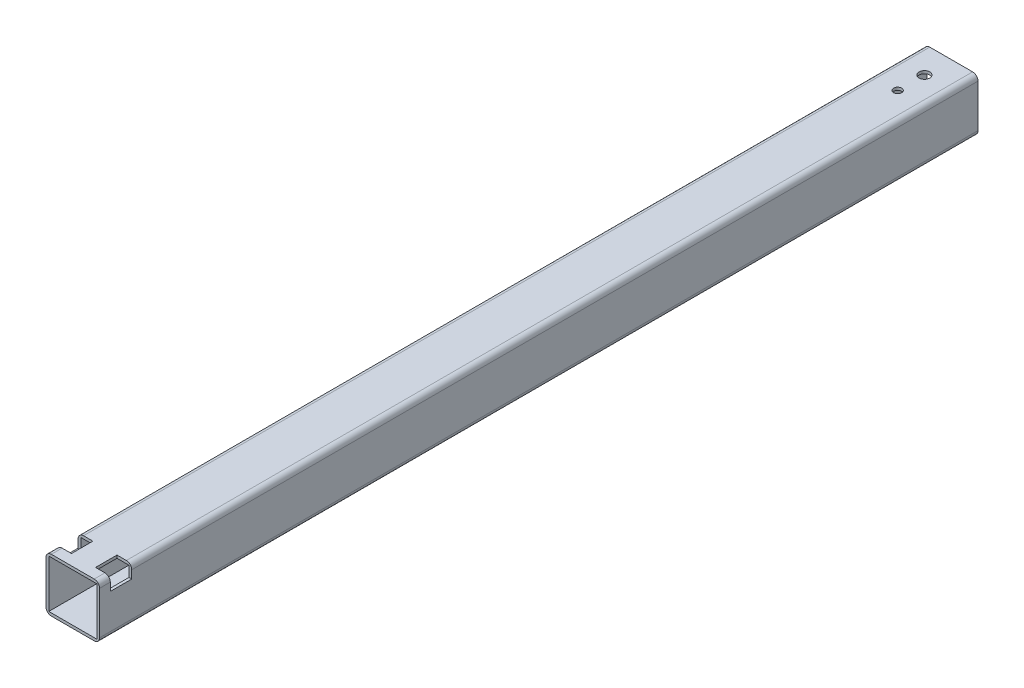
ISO-10303-21;
HEADER;
FILE_DESCRIPTION(('STEP AP214'),'2;1');
FILE_NAME('part.step','',(''),(''),'','','');
FILE_SCHEMA(('AUTOMOTIVE_DESIGN { 1 0 10303 214 1 1 1 1 }'));
ENDSEC;
DATA;
#1=APPLICATION_CONTEXT('core data for automotive mechanical design processes');
#2=APPLICATION_PROTOCOL_DEFINITION('international standard','automotive_design',2000,#1);
#3=PRODUCT_CONTEXT('',#1,'mechanical');
#4=PRODUCT('Part','Part','',(#3));
#5=PRODUCT_RELATED_PRODUCT_CATEGORY('part','',(#4));
#6=PRODUCT_DEFINITION_FORMATION('','',#4);
#7=PRODUCT_DEFINITION_CONTEXT('part definition',#1,'design');
#8=PRODUCT_DEFINITION('design','',#6,#7);
#9=PRODUCT_DEFINITION_SHAPE('','',#8);
#10=(LENGTH_UNIT() NAMED_UNIT(*) SI_UNIT(.MILLI.,.METRE.));
#11=(NAMED_UNIT(*) PLANE_ANGLE_UNIT() SI_UNIT($,.RADIAN.));
#12=(NAMED_UNIT(*) SI_UNIT($,.STERADIAN.) SOLID_ANGLE_UNIT());
#13=UNCERTAINTY_MEASURE_WITH_UNIT(LENGTH_MEASURE(1.E-05),#10,'distance_accuracy_value','');
#14=(GEOMETRIC_REPRESENTATION_CONTEXT(3) GLOBAL_UNCERTAINTY_ASSIGNED_CONTEXT((#13)) GLOBAL_UNIT_ASSIGNED_CONTEXT((#10,
#11,#12)) REPRESENTATION_CONTEXT('',''));
#15=CARTESIAN_POINT('',(0.,0.,0.));
#16=DIRECTION('',(0.,0.,1.));
#17=DIRECTION('',(1.,0.,0.));
#18=AXIS2_PLACEMENT_3D('',#15,#16,#17);
#19=CARTESIAN_POINT('',(15.875,15.875,520.7));
#20=DIRECTION('',(0.,-1.,0.));
#21=DIRECTION('',(0.,0.,-1.));
#22=AXIS2_PLACEMENT_3D('',#19,#20,#21);
#23=PLANE('',#22);
#24=CARTESIAN_POINT('',(0.,15.875,31.75));
#25=DIRECTION('',(0.,-1.,0.));
#26=DIRECTION('',(0.,0.,-1.));
#27=AXIS2_PLACEMENT_3D('',#24,#25,#26);
#28=CIRCLE('',#27,2.3876);
#29=CARTESIAN_POINT('',(0.,15.875,29.3624));
#30=VERTEX_POINT('',#29);
#31=EDGE_CURVE('E311',#30,#30,#28,.T.);
#32=ORIENTED_EDGE('',*,*,#31,.T.);
#33=EDGE_LOOP('',(#32));
#34=FACE_BOUND('',#33,.T.);
#35=CARTESIAN_POINT('',(0.,15.875,15.875));
#36=DIRECTION('',(0.,-1.,0.));
#37=DIRECTION('',(0.,0.,-1.));
#38=AXIS2_PLACEMENT_3D('',#35,#36,#37);
#39=CIRCLE('',#38,3.175);
#40=CARTESIAN_POINT('',(0.,15.875,12.7));
#41=VERTEX_POINT('',#40);
#42=EDGE_CURVE('E321',#41,#41,#39,.T.);
#43=ORIENTED_EDGE('',*,*,#42,.T.);
#44=EDGE_LOOP('',(#43));
#45=FACE_BOUND('',#44,.T.);
#46=DIRECTION('',(-1.,0.,0.));
#47=VECTOR('',#46,1.);
#48=CARTESIAN_POINT('',(15.875,15.875,501.65));
#49=LINE('',#48,#47);
#50=CARTESIAN_POINT('',(-7.13739999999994,15.875,501.65));
#51=VERTEX_POINT('',#50);
#52=CARTESIAN_POINT('',(-12.7,15.875,501.65));
#53=VERTEX_POINT('',#52);
#54=EDGE_CURVE('E263',#51,#53,#49,.T.);
#55=ORIENTED_EDGE('',*,*,#54,.F.);
#56=DIRECTION('',(0.,0.,-1.));
#57=VECTOR('',#56,1.);
#58=CARTESIAN_POINT('',(-7.13739999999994,15.875,520.7));
#59=LINE('',#58,#57);
#60=CARTESIAN_POINT('',(-7.13739999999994,15.875,514.35));
#61=VERTEX_POINT('',#60);
#62=EDGE_CURVE('E235',#61,#51,#59,.T.);
#63=ORIENTED_EDGE('',*,*,#62,.F.);
#64=DIRECTION('',(1.,0.,0.));
#65=VECTOR('',#64,1.);
#66=CARTESIAN_POINT('',(15.875,15.875,514.35));
#67=LINE('',#66,#65);
#68=CARTESIAN_POINT('',(-12.7,15.875,514.35));
#69=VERTEX_POINT('',#68);
#70=EDGE_CURVE('E249',#69,#61,#67,.T.);
#71=ORIENTED_EDGE('',*,*,#70,.F.);
#72=DIRECTION('',(0.,0.,-1.));
#73=VECTOR('',#72,1.);
#74=CARTESIAN_POINT('',(-12.7,15.875,520.7));
#75=LINE('',#74,#73);
#76=CARTESIAN_POINT('',(-12.7,15.875,520.7));
#77=VERTEX_POINT('',#76);
#78=EDGE_CURVE('E421',#69,#77,#75,.F.);
#79=ORIENTED_EDGE('',*,*,#78,.T.);
#80=DIRECTION('',(-1.,0.,0.));
#81=VECTOR('',#80,1.);
#82=CARTESIAN_POINT('',(15.875,15.875,520.7));
#83=LINE('',#82,#81);
#84=CARTESIAN_POINT('',(12.7,15.875,520.7));
#85=VERTEX_POINT('',#84);
#86=EDGE_CURVE('E372',#85,#77,#83,.T.);
#87=ORIENTED_EDGE('',*,*,#86,.F.);
#88=DIRECTION('',(0.,0.,-1.));
#89=VECTOR('',#88,1.);
#90=CARTESIAN_POINT('',(12.7,15.875,520.7));
#91=LINE('',#90,#89);
#92=CARTESIAN_POINT('',(12.7,15.875,514.35));
#93=VERTEX_POINT('',#92);
#94=EDGE_CURVE('E418',#85,#93,#91,.T.);
#95=ORIENTED_EDGE('',*,*,#94,.T.);
#96=DIRECTION('',(1.,0.,0.));
#97=VECTOR('',#96,1.);
#98=CARTESIAN_POINT('',(15.875,15.875,514.35));
#99=LINE('',#98,#97);
#100=CARTESIAN_POINT('',(7.13740000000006,15.875,514.35));
#101=VERTEX_POINT('',#100);
#102=EDGE_CURVE('E292',#101,#93,#99,.T.);
#103=ORIENTED_EDGE('',*,*,#102,.F.);
#104=DIRECTION('',(0.,0.,1.));
#105=VECTOR('',#104,1.);
#106=CARTESIAN_POINT('',(7.13740000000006,15.875,520.7));
#107=LINE('',#106,#105);
#108=CARTESIAN_POINT('',(7.13740000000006,15.875,501.65));
#109=VERTEX_POINT('',#108);
#110=EDGE_CURVE('E302',#109,#101,#107,.T.);
#111=ORIENTED_EDGE('',*,*,#110,.F.);
#112=DIRECTION('',(-1.,0.,0.));
#113=VECTOR('',#112,1.);
#114=CARTESIAN_POINT('',(15.875,15.875,501.65));
#115=LINE('',#114,#113);
#116=CARTESIAN_POINT('',(12.7,15.875,501.65));
#117=VERTEX_POINT('',#116);
#118=EDGE_CURVE('E282',#117,#109,#115,.T.);
#119=ORIENTED_EDGE('',*,*,#118,.F.);
#120=CARTESIAN_POINT('',(12.7,15.875,0.));
#121=VERTEX_POINT('',#120);
#122=EDGE_CURVE('E417',#117,#121,#91,.T.);
#123=ORIENTED_EDGE('',*,*,#122,.T.);
#124=DIRECTION('',(-1.,0.,0.));
#125=VECTOR('',#124,1.);
#126=CARTESIAN_POINT('',(15.875,15.875,0.));
#127=LINE('',#126,#125);
#128=CARTESIAN_POINT('',(-12.7,15.875,0.));
#129=VERTEX_POINT('',#128);
#130=EDGE_CURVE('E366',#121,#129,#127,.T.);
#131=ORIENTED_EDGE('',*,*,#130,.T.);
#132=EDGE_CURVE('E422',#129,#53,#75,.F.);
#133=ORIENTED_EDGE('',*,*,#132,.T.);
#134=EDGE_LOOP('',(#55,#63,#71,#79,#87,#95,#103,#111,#119,#123,#131,#133));
#135=FACE_BOUND('',#134,.T.);
#136=ADVANCED_FACE('F56',(#34,#45,#135),#23,.F.);
#137=CARTESIAN_POINT('',(0.,14.224,520.7));
#138=DIRECTION('',(0.,-1.,0.));
#139=DIRECTION('',(0.,0.,-1.));
#140=AXIS2_PLACEMENT_3D('',#137,#138,#139);
#141=PLANE('',#140);
#142=CARTESIAN_POINT('',(0.,14.224,31.75));
#143=DIRECTION('',(0.,-1.,0.));
#144=DIRECTION('',(0.,0.,-1.));
#145=AXIS2_PLACEMENT_3D('',#142,#143,#144);
#146=CIRCLE('',#145,2.3876);
#147=CARTESIAN_POINT('',(0.,14.224,29.3624));
#148=VERTEX_POINT('',#147);
#149=EDGE_CURVE('E307',#148,#148,#146,.T.);
#150=ORIENTED_EDGE('',*,*,#149,.F.);
#151=EDGE_LOOP('',(#150));
#152=FACE_BOUND('',#151,.T.);
#153=CARTESIAN_POINT('',(0.,14.224,15.875));
#154=DIRECTION('',(0.,-1.,0.));
#155=DIRECTION('',(0.,0.,-1.));
#156=AXIS2_PLACEMENT_3D('',#153,#154,#155);
#157=CIRCLE('',#156,3.175);
#158=CARTESIAN_POINT('',(0.,14.224,12.7));
#159=VERTEX_POINT('',#158);
#160=EDGE_CURVE('E317',#159,#159,#157,.T.);
#161=ORIENTED_EDGE('',*,*,#160,.F.);
#162=EDGE_LOOP('',(#161));
#163=FACE_BOUND('',#162,.T.);
#164=DIRECTION('',(0.,0.,-1.));
#165=VECTOR('',#164,1.);
#166=CARTESIAN_POINT('',(-7.13739999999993,14.224,520.7));
#167=LINE('',#166,#165);
#168=CARTESIAN_POINT('',(-7.13739999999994,14.224,514.35));
#169=VERTEX_POINT('',#168);
#170=CARTESIAN_POINT('',(-7.13739999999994,14.224,501.65));
#171=VERTEX_POINT('',#170);
#172=EDGE_CURVE('E12',#169,#171,#167,.T.);
#173=ORIENTED_EDGE('',*,*,#172,.T.);
#174=DIRECTION('',(-1.,0.,0.));
#175=VECTOR('',#174,1.);
#176=CARTESIAN_POINT('',(0.,14.224,501.65));
#177=LINE('',#176,#175);
#178=CARTESIAN_POINT('',(-14.224,14.224,501.65));
#179=VERTEX_POINT('',#178);
#180=EDGE_CURVE('E236',#171,#179,#177,.T.);
#181=ORIENTED_EDGE('',*,*,#180,.T.);
#182=DIRECTION('',(0.,0.,-1.));
#183=VECTOR('',#182,1.);
#184=CARTESIAN_POINT('',(-14.224,14.224,520.7));
#185=LINE('',#184,#183);
#186=CARTESIAN_POINT('',(-14.224,14.224,0.));
#187=VERTEX_POINT('',#186);
#188=EDGE_CURVE('E338',#179,#187,#185,.T.);
#189=ORIENTED_EDGE('',*,*,#188,.T.);
#190=DIRECTION('',(-1.,0.,0.));
#191=VECTOR('',#190,1.);
#192=CARTESIAN_POINT('',(0.,14.224,0.));
#193=LINE('',#192,#191);
#194=CARTESIAN_POINT('',(14.224,14.224,0.));
#195=VERTEX_POINT('',#194);
#196=EDGE_CURVE('E331',#195,#187,#193,.T.);
#197=ORIENTED_EDGE('',*,*,#196,.F.);
#198=DIRECTION('',(0.,0.,-1.));
#199=VECTOR('',#198,1.);
#200=CARTESIAN_POINT('',(14.224,14.224,520.7));
#201=LINE('',#200,#199);
#202=CARTESIAN_POINT('',(14.224,14.224,501.65));
#203=VERTEX_POINT('',#202);
#204=EDGE_CURVE('E352',#203,#195,#201,.T.);
#205=ORIENTED_EDGE('',*,*,#204,.F.);
#206=DIRECTION('',(-1.,0.,0.));
#207=VECTOR('',#206,1.);
#208=CARTESIAN_POINT('',(0.,14.224,501.65));
#209=LINE('',#208,#207);
#210=CARTESIAN_POINT('',(7.13740000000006,14.224,501.65));
#211=VERTEX_POINT('',#210);
#212=EDGE_CURVE('E286',#203,#211,#209,.T.);
#213=ORIENTED_EDGE('',*,*,#212,.T.);
#214=DIRECTION('',(0.,0.,1.));
#215=VECTOR('',#214,1.);
#216=CARTESIAN_POINT('',(7.13740000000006,14.224,520.7));
#217=LINE('',#216,#215);
#218=CARTESIAN_POINT('',(7.13740000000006,14.224,514.35));
#219=VERTEX_POINT('',#218);
#220=EDGE_CURVE('E435',#211,#219,#217,.T.);
#221=ORIENTED_EDGE('',*,*,#220,.T.);
#222=DIRECTION('',(1.,0.,0.));
#223=VECTOR('',#222,1.);
#224=CARTESIAN_POINT('',(0.,14.224,514.35));
#225=LINE('',#224,#223);
#226=CARTESIAN_POINT('',(14.224,14.224,514.35));
#227=VERTEX_POINT('',#226);
#228=EDGE_CURVE('E296',#219,#227,#225,.T.);
#229=ORIENTED_EDGE('',*,*,#228,.T.);
#230=CARTESIAN_POINT('',(14.224,14.224,520.7));
#231=VERTEX_POINT('',#230);
#232=EDGE_CURVE('E353',#231,#227,#201,.T.);
#233=ORIENTED_EDGE('',*,*,#232,.F.);
#234=DIRECTION('',(-1.,0.,0.));
#235=VECTOR('',#234,1.);
#236=CARTESIAN_POINT('',(0.,14.224,520.7));
#237=LINE('',#236,#235);
#238=CARTESIAN_POINT('',(-14.224,14.224,520.7));
#239=VERTEX_POINT('',#238);
#240=EDGE_CURVE('E336',#231,#239,#237,.T.);
#241=ORIENTED_EDGE('',*,*,#240,.T.);
#242=CARTESIAN_POINT('',(-14.224,14.224,514.35));
#243=VERTEX_POINT('',#242);
#244=EDGE_CURVE('E349',#239,#243,#185,.T.);
#245=ORIENTED_EDGE('',*,*,#244,.T.);
#246=DIRECTION('',(1.,0.,0.));
#247=VECTOR('',#246,1.);
#248=CARTESIAN_POINT('',(0.,14.224,514.35));
#249=LINE('',#248,#247);
#250=EDGE_CURVE('E258',#243,#169,#249,.T.);
#251=ORIENTED_EDGE('',*,*,#250,.T.);
#252=EDGE_LOOP('',(#173,#181,#189,#197,#205,#213,#221,#229,#233,#241,#245,#251));
#253=FACE_BOUND('',#252,.T.);
#254=ADVANCED_FACE('F456',(#152,#163,#253),#141,.T.);
#255=CARTESIAN_POINT('',(-15.875,15.875,520.7));
#256=DIRECTION('',(1.,0.,0.));
#257=DIRECTION('',(0.,1.,0.));
#258=AXIS2_PLACEMENT_3D('',#255,#256,#257);
#259=PLANE('',#258);
#260=DIRECTION('',(0.,-1.,0.));
#261=VECTOR('',#260,1.);
#262=CARTESIAN_POINT('',(-15.875,15.875,501.65));
#263=LINE('',#262,#261);
#264=CARTESIAN_POINT('',(-15.875,12.7,501.65));
#265=VERTEX_POINT('',#264);
#266=CARTESIAN_POINT('',(-15.875,7.9248,501.65));
#267=VERTEX_POINT('',#266);
#268=EDGE_CURVE('E261',#265,#267,#263,.T.);
#269=ORIENTED_EDGE('',*,*,#268,.F.);
#270=DIRECTION('',(0.,0.,-1.));
#271=VECTOR('',#270,1.);
#272=CARTESIAN_POINT('',(-15.875,12.7,520.7));
#273=LINE('',#272,#271);
#274=CARTESIAN_POINT('',(-15.875,12.7,0.));
#275=VERTEX_POINT('',#274);
#276=EDGE_CURVE('E413',#265,#275,#273,.T.);
#277=ORIENTED_EDGE('',*,*,#276,.T.);
#278=DIRECTION('',(0.,-1.,0.));
#279=VECTOR('',#278,1.);
#280=CARTESIAN_POINT('',(-15.875,15.875,0.));
#281=LINE('',#280,#279);
#282=CARTESIAN_POINT('',(-15.875,-12.7,0.));
#283=VERTEX_POINT('',#282);
#284=EDGE_CURVE('E361',#275,#283,#281,.T.);
#285=ORIENTED_EDGE('',*,*,#284,.T.);
#286=DIRECTION('',(0.,0.,-1.));
#287=VECTOR('',#286,1.);
#288=CARTESIAN_POINT('',(-15.875,-12.7,520.7));
#289=LINE('',#288,#287);
#290=CARTESIAN_POINT('',(-15.875,-12.7,520.7));
#291=VERTEX_POINT('',#290);
#292=EDGE_CURVE('E415',#283,#291,#289,.F.);
#293=ORIENTED_EDGE('',*,*,#292,.T.);
#294=DIRECTION('',(0.,-1.,0.));
#295=VECTOR('',#294,1.);
#296=CARTESIAN_POINT('',(-15.875,15.875,520.7));
#297=LINE('',#296,#295);
#298=CARTESIAN_POINT('',(-15.875,12.7,520.7));
#299=VERTEX_POINT('',#298);
#300=EDGE_CURVE('E362',#299,#291,#297,.T.);
#301=ORIENTED_EDGE('',*,*,#300,.F.);
#302=CARTESIAN_POINT('',(-15.875,12.7,514.35));
#303=VERTEX_POINT('',#302);
#304=EDGE_CURVE('E248',#299,#303,#273,.T.);
#305=ORIENTED_EDGE('',*,*,#304,.T.);
#306=DIRECTION('',(0.,1.,0.));
#307=VECTOR('',#306,1.);
#308=CARTESIAN_POINT('',(-15.875,15.875,514.35));
#309=LINE('',#308,#307);
#310=CARTESIAN_POINT('',(-15.875,7.9248,514.35));
#311=VERTEX_POINT('',#310);
#312=EDGE_CURVE('E79',#311,#303,#309,.T.);
#313=ORIENTED_EDGE('',*,*,#312,.F.);
#314=DIRECTION('',(0.,0.,-1.));
#315=VECTOR('',#314,1.);
#316=CARTESIAN_POINT('',(-15.875,7.9248,520.7));
#317=LINE('',#316,#315);
#318=EDGE_CURVE('E229',#311,#267,#317,.T.);
#319=ORIENTED_EDGE('',*,*,#318,.T.);
#320=EDGE_LOOP('',(#269,#277,#285,#293,#301,#305,#313,#319));
#321=FACE_BOUND('',#320,.T.);
#322=ADVANCED_FACE('F245',(#321),#259,.F.);
#323=CARTESIAN_POINT('',(-14.224,0.,520.7));
#324=DIRECTION('',(1.,0.,0.));
#325=DIRECTION('',(0.,1.,0.));
#326=AXIS2_PLACEMENT_3D('',#323,#324,#325);
#327=PLANE('',#326);
#328=ORIENTED_EDGE('',*,*,#188,.F.);
#329=DIRECTION('',(0.,-1.,0.));
#330=VECTOR('',#329,1.);
#331=CARTESIAN_POINT('',(-14.224,0.,501.65));
#332=LINE('',#331,#330);
#333=CARTESIAN_POINT('',(-14.224,7.9248,501.65));
#334=VERTEX_POINT('',#333);
#335=EDGE_CURVE('E265',#179,#334,#332,.T.);
#336=ORIENTED_EDGE('',*,*,#335,.T.);
#337=DIRECTION('',(0.,0.,-1.));
#338=VECTOR('',#337,1.);
#339=CARTESIAN_POINT('',(-14.224,7.9248,520.7));
#340=LINE('',#339,#338);
#341=CARTESIAN_POINT('',(-14.224,7.9248,514.35));
#342=VERTEX_POINT('',#341);
#343=EDGE_CURVE('E65',#342,#334,#340,.T.);
#344=ORIENTED_EDGE('',*,*,#343,.F.);
#345=DIRECTION('',(0.,1.,0.));
#346=VECTOR('',#345,1.);
#347=CARTESIAN_POINT('',(-14.224,0.,514.35));
#348=LINE('',#347,#346);
#349=EDGE_CURVE('E240',#342,#243,#348,.T.);
#350=ORIENTED_EDGE('',*,*,#349,.T.);
#351=ORIENTED_EDGE('',*,*,#244,.F.);
#352=DIRECTION('',(0.,-1.,0.));
#353=VECTOR('',#352,1.);
#354=CARTESIAN_POINT('',(-14.224,0.,520.7));
#355=LINE('',#354,#353);
#356=CARTESIAN_POINT('',(-14.224,-14.224,520.7));
#357=VERTEX_POINT('',#356);
#358=EDGE_CURVE('E328',#239,#357,#355,.T.);
#359=ORIENTED_EDGE('',*,*,#358,.T.);
#360=DIRECTION('',(0.,0.,-1.));
#361=VECTOR('',#360,1.);
#362=CARTESIAN_POINT('',(-14.224,-14.224,520.7));
#363=LINE('',#362,#361);
#364=CARTESIAN_POINT('',(-14.224,-14.224,0.));
#365=VERTEX_POINT('',#364);
#366=EDGE_CURVE('E358',#357,#365,#363,.T.);
#367=ORIENTED_EDGE('',*,*,#366,.T.);
#368=DIRECTION('',(0.,-1.,0.));
#369=VECTOR('',#368,1.);
#370=CARTESIAN_POINT('',(-14.224,0.,0.));
#371=LINE('',#370,#369);
#372=EDGE_CURVE('E327',#187,#365,#371,.T.);
#373=ORIENTED_EDGE('',*,*,#372,.F.);
#374=EDGE_LOOP('',(#328,#336,#344,#350,#351,#359,#367,#373));
#375=FACE_BOUND('',#374,.T.);
#376=ADVANCED_FACE('F452',(#375),#327,.T.);
#377=CARTESIAN_POINT('',(-12.7,12.7,520.7));
#378=DIRECTION('',(0.,0.,-1.));
#379=DIRECTION('',(-1.,0.,0.));
#380=AXIS2_PLACEMENT_3D('',#377,#378,#379);
#381=CYLINDRICAL_SURFACE('',#380,3.175);
#382=ORIENTED_EDGE('',*,*,#276,.F.);
#383=CARTESIAN_POINT('',(-12.7,12.7,501.65));
#384=DIRECTION('',(0.,0.,1.));
#385=DIRECTION('',(1.,0.,0.));
#386=AXIS2_PLACEMENT_3D('',#383,#384,#385);
#387=CIRCLE('',#386,3.175);
#388=EDGE_CURVE('E442',#265,#53,#387,.F.);
#389=ORIENTED_EDGE('',*,*,#388,.T.);
#390=ORIENTED_EDGE('',*,*,#132,.F.);
#391=CARTESIAN_POINT('',(-12.7,12.7,0.));
#392=DIRECTION('',(0.,0.,1.));
#393=DIRECTION('',(1.,0.,0.));
#394=AXIS2_PLACEMENT_3D('',#391,#392,#393);
#395=CIRCLE('',#394,3.175);
#396=EDGE_CURVE('E394',#275,#129,#395,.F.);
#397=ORIENTED_EDGE('',*,*,#396,.F.);
#398=EDGE_LOOP('',(#382,#389,#390,#397));
#399=FACE_BOUND('',#398,.T.);
#400=ADVANCED_FACE('F572',(#399),#381,.T.);
#401=ORIENTED_EDGE('',*,*,#78,.F.);
#402=CARTESIAN_POINT('',(-12.7,12.7,514.35));
#403=DIRECTION('',(0.,0.,-1.));
#404=DIRECTION('',(-1.,0.,0.));
#405=AXIS2_PLACEMENT_3D('',#402,#403,#404);
#406=CIRCLE('',#405,3.175);
#407=EDGE_CURVE('E440',#69,#303,#406,.F.);
#408=ORIENTED_EDGE('',*,*,#407,.T.);
#409=ORIENTED_EDGE('',*,*,#304,.F.);
#410=CARTESIAN_POINT('',(-12.7,12.7,520.7));
#411=DIRECTION('',(0.,0.,1.));
#412=DIRECTION('',(1.,0.,0.));
#413=AXIS2_PLACEMENT_3D('',#410,#411,#412);
#414=CIRCLE('',#413,3.175);
#415=EDGE_CURVE('E407',#77,#299,#414,.T.);
#416=ORIENTED_EDGE('',*,*,#415,.F.);
#417=EDGE_LOOP('',(#401,#408,#409,#416));
#418=FACE_BOUND('',#417,.T.);
#419=ADVANCED_FACE('F561',(#418),#381,.T.);
#420=CARTESIAN_POINT('',(15.875,15.875,520.7));
#421=DIRECTION('',(-1.,0.,0.));
#422=DIRECTION('',(0.,-1.,0.));
#423=AXIS2_PLACEMENT_3D('',#420,#421,#422);
#424=PLANE('',#423);
#425=DIRECTION('',(0.,-1.,0.));
#426=VECTOR('',#425,1.);
#427=CARTESIAN_POINT('',(15.875,15.875,514.35));
#428=LINE('',#427,#426);
#429=CARTESIAN_POINT('',(15.875,12.7,514.35));
#430=VERTEX_POINT('',#429);
#431=CARTESIAN_POINT('',(15.875,7.9248,514.35));
#432=VERTEX_POINT('',#431);
#433=EDGE_CURVE('E294',#430,#432,#428,.T.);
#434=ORIENTED_EDGE('',*,*,#433,.F.);
#435=DIRECTION('',(0.,0.,-1.));
#436=VECTOR('',#435,1.);
#437=CARTESIAN_POINT('',(15.875,12.7,520.7));
#438=LINE('',#437,#436);
#439=CARTESIAN_POINT('',(15.875,12.7,520.7));
#440=VERTEX_POINT('',#439);
#441=EDGE_CURVE('E375',#430,#440,#438,.F.);
#442=ORIENTED_EDGE('',*,*,#441,.T.);
#443=DIRECTION('',(0.,1.,0.));
#444=VECTOR('',#443,1.);
#445=CARTESIAN_POINT('',(15.875,15.875,520.7));
#446=LINE('',#445,#444);
#447=CARTESIAN_POINT('',(15.875,-12.7,520.7));
#448=VERTEX_POINT('',#447);
#449=EDGE_CURVE('E369',#448,#440,#446,.T.);
#450=ORIENTED_EDGE('',*,*,#449,.F.);
#451=DIRECTION('',(0.,0.,-1.));
#452=VECTOR('',#451,1.);
#453=CARTESIAN_POINT('',(15.875,-12.7,520.7));
#454=LINE('',#453,#452);
#455=CARTESIAN_POINT('',(15.875,-12.7,0.));
#456=VERTEX_POINT('',#455);
#457=EDGE_CURVE('E389',#448,#456,#454,.T.);
#458=ORIENTED_EDGE('',*,*,#457,.T.);
#459=DIRECTION('',(0.,1.,0.));
#460=VECTOR('',#459,1.);
#461=CARTESIAN_POINT('',(15.875,15.875,0.));
#462=LINE('',#461,#460);
#463=CARTESIAN_POINT('',(15.875,12.7,0.));
#464=VERTEX_POINT('',#463);
#465=EDGE_CURVE('E381',#456,#464,#462,.T.);
#466=ORIENTED_EDGE('',*,*,#465,.T.);
#467=CARTESIAN_POINT('',(15.875,12.7,501.65));
#468=VERTEX_POINT('',#467);
#469=EDGE_CURVE('E386',#464,#468,#438,.F.);
#470=ORIENTED_EDGE('',*,*,#469,.T.);
#471=DIRECTION('',(0.,1.,0.));
#472=VECTOR('',#471,1.);
#473=CARTESIAN_POINT('',(15.875,15.875,501.65));
#474=LINE('',#473,#472);
#475=CARTESIAN_POINT('',(15.875,7.9248,501.65));
#476=VERTEX_POINT('',#475);
#477=EDGE_CURVE('E284',#476,#468,#474,.T.);
#478=ORIENTED_EDGE('',*,*,#477,.F.);
#479=DIRECTION('',(0.,0.,1.));
#480=VECTOR('',#479,1.);
#481=CARTESIAN_POINT('',(15.875,7.9248,520.7));
#482=LINE('',#481,#480);
#483=EDGE_CURVE('E304',#476,#432,#482,.T.);
#484=ORIENTED_EDGE('',*,*,#483,.T.);
#485=EDGE_LOOP('',(#434,#442,#450,#458,#466,#470,#478,#484));
#486=FACE_BOUND('',#485,.T.);
#487=ADVANCED_FACE('F519',(#486),#424,.F.);
#488=CARTESIAN_POINT('',(14.224,0.,520.7));
#489=DIRECTION('',(-1.,0.,0.));
#490=DIRECTION('',(0.,-1.,0.));
#491=AXIS2_PLACEMENT_3D('',#488,#489,#490);
#492=PLANE('',#491);
#493=ORIENTED_EDGE('',*,*,#232,.T.);
#494=DIRECTION('',(0.,-1.,0.));
#495=VECTOR('',#494,1.);
#496=CARTESIAN_POINT('',(14.224,0.,514.35));
#497=LINE('',#496,#495);
#498=CARTESIAN_POINT('',(14.224,7.9248,514.35));
#499=VERTEX_POINT('',#498);
#500=EDGE_CURVE('E299',#227,#499,#497,.T.);
#501=ORIENTED_EDGE('',*,*,#500,.T.);
#502=DIRECTION('',(0.,0.,1.));
#503=VECTOR('',#502,1.);
#504=CARTESIAN_POINT('',(14.224,7.9248,520.7));
#505=LINE('',#504,#503);
#506=CARTESIAN_POINT('',(14.224,7.9248,501.65));
#507=VERTEX_POINT('',#506);
#508=EDGE_CURVE('E438',#507,#499,#505,.T.);
#509=ORIENTED_EDGE('',*,*,#508,.F.);
#510=DIRECTION('',(0.,1.,0.));
#511=VECTOR('',#510,1.);
#512=CARTESIAN_POINT('',(14.224,0.,501.65));
#513=LINE('',#512,#511);
#514=EDGE_CURVE('E289',#507,#203,#513,.T.);
#515=ORIENTED_EDGE('',*,*,#514,.T.);
#516=ORIENTED_EDGE('',*,*,#204,.T.);
#517=DIRECTION('',(0.,1.,0.));
#518=VECTOR('',#517,1.);
#519=CARTESIAN_POINT('',(14.224,0.,0.));
#520=LINE('',#519,#518);
#521=CARTESIAN_POINT('',(14.224,-14.224,0.));
#522=VERTEX_POINT('',#521);
#523=EDGE_CURVE('E344',#522,#195,#520,.T.);
#524=ORIENTED_EDGE('',*,*,#523,.F.);
#525=DIRECTION('',(0.,0.,-1.));
#526=VECTOR('',#525,1.);
#527=CARTESIAN_POINT('',(14.224,-14.224,520.7));
#528=LINE('',#527,#526);
#529=CARTESIAN_POINT('',(14.224,-14.224,520.7));
#530=VERTEX_POINT('',#529);
#531=EDGE_CURVE('E356',#530,#522,#528,.T.);
#532=ORIENTED_EDGE('',*,*,#531,.F.);
#533=DIRECTION('',(0.,1.,0.));
#534=VECTOR('',#533,1.);
#535=CARTESIAN_POINT('',(14.224,0.,520.7));
#536=LINE('',#535,#534);
#537=EDGE_CURVE('E333',#530,#231,#536,.T.);
#538=ORIENTED_EDGE('',*,*,#537,.T.);
#539=EDGE_LOOP('',(#493,#501,#509,#515,#516,#524,#532,#538));
#540=FACE_BOUND('',#539,.T.);
#541=ADVANCED_FACE('F493',(#540),#492,.T.);
#542=CARTESIAN_POINT('',(12.7,12.7,520.7));
#543=DIRECTION('',(0.,0.,-1.));
#544=DIRECTION('',(-1.,0.,0.));
#545=AXIS2_PLACEMENT_3D('',#542,#543,#544);
#546=CYLINDRICAL_SURFACE('',#545,3.175);
#547=ORIENTED_EDGE('',*,*,#441,.F.);
#548=CARTESIAN_POINT('',(12.7,12.7,514.35));
#549=DIRECTION('',(0.,0.,-1.));
#550=DIRECTION('',(-1.,0.,0.));
#551=AXIS2_PLACEMENT_3D('',#548,#549,#550);
#552=CIRCLE('',#551,3.175);
#553=EDGE_CURVE('E432',#430,#93,#552,.F.);
#554=ORIENTED_EDGE('',*,*,#553,.T.);
#555=ORIENTED_EDGE('',*,*,#94,.F.);
#556=CARTESIAN_POINT('',(12.7,12.7,520.7));
#557=DIRECTION('',(0.,0.,1.));
#558=DIRECTION('',(1.,0.,0.));
#559=AXIS2_PLACEMENT_3D('',#556,#557,#558);
#560=CIRCLE('',#559,3.175);
#561=EDGE_CURVE('E405',#440,#85,#560,.T.);
#562=ORIENTED_EDGE('',*,*,#561,.F.);
#563=EDGE_LOOP('',(#547,#554,#555,#562));
#564=FACE_BOUND('',#563,.T.);
#565=ADVANCED_FACE('F58',(#564),#546,.T.);
#566=ORIENTED_EDGE('',*,*,#122,.F.);
#567=CARTESIAN_POINT('',(12.7,12.7,501.65));
#568=DIRECTION('',(0.,0.,1.));
#569=DIRECTION('',(1.,0.,0.));
#570=AXIS2_PLACEMENT_3D('',#567,#568,#569);
#571=CIRCLE('',#570,3.175);
#572=EDGE_CURVE('E425',#117,#468,#571,.F.);
#573=ORIENTED_EDGE('',*,*,#572,.T.);
#574=ORIENTED_EDGE('',*,*,#469,.F.);
#575=CARTESIAN_POINT('',(12.7,12.7,0.));
#576=DIRECTION('',(0.,0.,1.));
#577=DIRECTION('',(1.,0.,0.));
#578=AXIS2_PLACEMENT_3D('',#575,#576,#577);
#579=CIRCLE('',#578,3.175);
#580=EDGE_CURVE('E392',#121,#464,#579,.F.);
#581=ORIENTED_EDGE('',*,*,#580,.F.);
#582=EDGE_LOOP('',(#566,#573,#574,#581));
#583=FACE_BOUND('',#582,.T.);
#584=ADVANCED_FACE('F535',(#583),#546,.T.);
#585=CARTESIAN_POINT('',(0.,0.,520.7));
#586=DIRECTION('',(0.,0.,1.));
#587=DIRECTION('',(1.,0.,0.));
#588=AXIS2_PLACEMENT_3D('',#585,#586,#587);
#589=PLANE('',#588);
#590=DIRECTION('',(1.,0.,0.));
#591=VECTOR('',#590,1.);
#592=CARTESIAN_POINT('',(15.875,-15.875,520.7));
#593=LINE('',#592,#591);
#594=CARTESIAN_POINT('',(-12.7,-15.875,520.7));
#595=VERTEX_POINT('',#594);
#596=CARTESIAN_POINT('',(12.7,-15.875,520.7));
#597=VERTEX_POINT('',#596);
#598=EDGE_CURVE('E365',#595,#597,#593,.T.);
#599=ORIENTED_EDGE('',*,*,#598,.T.);
#600=CARTESIAN_POINT('',(12.7,-12.7,520.7));
#601=DIRECTION('',(0.,0.,1.));
#602=DIRECTION('',(1.,0.,0.));
#603=AXIS2_PLACEMENT_3D('',#600,#601,#602);
#604=CIRCLE('',#603,3.175);
#605=EDGE_CURVE('E411',#597,#448,#604,.T.);
#606=ORIENTED_EDGE('',*,*,#605,.T.);
#607=ORIENTED_EDGE('',*,*,#449,.T.);
#608=ORIENTED_EDGE('',*,*,#561,.T.);
#609=ORIENTED_EDGE('',*,*,#86,.T.);
#610=ORIENTED_EDGE('',*,*,#415,.T.);
#611=ORIENTED_EDGE('',*,*,#300,.T.);
#612=CARTESIAN_POINT('',(-12.7,-12.7,520.7));
#613=DIRECTION('',(0.,0.,1.));
#614=DIRECTION('',(1.,0.,0.));
#615=AXIS2_PLACEMENT_3D('',#612,#613,#614);
#616=CIRCLE('',#615,3.175);
#617=EDGE_CURVE('E409',#291,#595,#616,.T.);
#618=ORIENTED_EDGE('',*,*,#617,.T.);
#619=EDGE_LOOP('',(#599,#606,#607,#608,#609,#610,#611,#618));
#620=FACE_BOUND('',#619,.T.);
#621=DIRECTION('',(1.,0.,0.));
#622=VECTOR('',#621,1.);
#623=CARTESIAN_POINT('',(0.,-14.224,520.7));
#624=LINE('',#623,#622);
#625=EDGE_CURVE('E330',#357,#530,#624,.T.);
#626=ORIENTED_EDGE('',*,*,#625,.F.);
#627=ORIENTED_EDGE('',*,*,#358,.F.);
#628=ORIENTED_EDGE('',*,*,#240,.F.);
#629=ORIENTED_EDGE('',*,*,#537,.F.);
#630=EDGE_LOOP('',(#626,#627,#628,#629));
#631=FACE_BOUND('',#630,.T.);
#632=ADVANCED_FACE('F522',(#620,#631),#589,.T.);
#633=CARTESIAN_POINT('',(0.,0.,0.));
#634=DIRECTION('',(0.,0.,1.));
#635=DIRECTION('',(1.,0.,0.));
#636=AXIS2_PLACEMENT_3D('',#633,#634,#635);
#637=PLANE('',#636);
#638=ORIENTED_EDGE('',*,*,#465,.F.);
#639=CARTESIAN_POINT('',(12.7,-12.7,0.));
#640=DIRECTION('',(0.,0.,1.));
#641=DIRECTION('',(1.,0.,0.));
#642=AXIS2_PLACEMENT_3D('',#639,#640,#641);
#643=CIRCLE('',#642,3.175);
#644=CARTESIAN_POINT('',(12.7,-15.875,0.));
#645=VERTEX_POINT('',#644);
#646=EDGE_CURVE('E398',#456,#645,#643,.F.);
#647=ORIENTED_EDGE('',*,*,#646,.T.);
#648=DIRECTION('',(1.,0.,0.));
#649=VECTOR('',#648,1.);
#650=CARTESIAN_POINT('',(15.875,-15.875,0.));
#651=LINE('',#650,#649);
#652=CARTESIAN_POINT('',(-12.7,-15.875,0.));
#653=VERTEX_POINT('',#652);
#654=EDGE_CURVE('E378',#653,#645,#651,.T.);
#655=ORIENTED_EDGE('',*,*,#654,.F.);
#656=CARTESIAN_POINT('',(-12.7,-12.7,0.));
#657=DIRECTION('',(0.,0.,1.));
#658=DIRECTION('',(1.,0.,0.));
#659=AXIS2_PLACEMENT_3D('',#656,#657,#658);
#660=CIRCLE('',#659,3.175);
#661=EDGE_CURVE('E396',#653,#283,#660,.F.);
#662=ORIENTED_EDGE('',*,*,#661,.T.);
#663=ORIENTED_EDGE('',*,*,#284,.F.);
#664=ORIENTED_EDGE('',*,*,#396,.T.);
#665=ORIENTED_EDGE('',*,*,#130,.F.);
#666=ORIENTED_EDGE('',*,*,#580,.T.);
#667=EDGE_LOOP('',(#638,#647,#655,#662,#663,#664,#665,#666));
#668=FACE_BOUND('',#667,.T.);
#669=ORIENTED_EDGE('',*,*,#372,.T.);
#670=DIRECTION('',(1.,0.,0.));
#671=VECTOR('',#670,1.);
#672=CARTESIAN_POINT('',(0.,-14.224,0.));
#673=LINE('',#672,#671);
#674=EDGE_CURVE('E341',#365,#522,#673,.T.);
#675=ORIENTED_EDGE('',*,*,#674,.T.);
#676=ORIENTED_EDGE('',*,*,#523,.T.);
#677=ORIENTED_EDGE('',*,*,#196,.T.);
#678=EDGE_LOOP('',(#669,#675,#676,#677));
#679=FACE_BOUND('',#678,.T.);
#680=ADVANCED_FACE('F491',(#668,#679),#637,.F.);
#681=CARTESIAN_POINT('',(15.875,-15.875,520.7));
#682=DIRECTION('',(0.,1.,0.));
#683=DIRECTION('',(0.,0.,1.));
#684=AXIS2_PLACEMENT_3D('',#681,#682,#683);
#685=PLANE('',#684);
#686=CARTESIAN_POINT('',(0.,-15.875,495.3));
#687=DIRECTION('',(0.,1.,0.));
#688=DIRECTION('',(0.,0.,1.));
#689=AXIS2_PLACEMENT_3D('',#686,#687,#688);
#690=CIRCLE('',#689,2.38760000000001);
#691=CARTESIAN_POINT('',(0.,-15.875,497.6876));
#692=VERTEX_POINT('',#691);
#693=EDGE_CURVE('E449',#692,#692,#690,.T.);
#694=ORIENTED_EDGE('',*,*,#693,.T.);
#695=EDGE_LOOP('',(#694));
#696=FACE_BOUND('',#695,.T.);
#697=CARTESIAN_POINT('',(0.,-15.875,31.75));
#698=DIRECTION('',(0.,1.,0.));
#699=DIRECTION('',(0.,0.,1.));
#700=AXIS2_PLACEMENT_3D('',#697,#698,#699);
#701=CIRCLE('',#700,2.3876);
#702=CARTESIAN_POINT('',(0.,-15.875,34.1376));
#703=VERTEX_POINT('',#702);
#704=EDGE_CURVE('E314',#703,#703,#701,.T.);
#705=ORIENTED_EDGE('',*,*,#704,.T.);
#706=EDGE_LOOP('',(#705));
#707=FACE_BOUND('',#706,.T.);
#708=CARTESIAN_POINT('',(0.,-15.875,15.875));
#709=DIRECTION('',(0.,1.,0.));
#710=DIRECTION('',(0.,0.,1.));
#711=AXIS2_PLACEMENT_3D('',#708,#709,#710);
#712=CIRCLE('',#711,3.175);
#713=CARTESIAN_POINT('',(0.,-15.875,19.05));
#714=VERTEX_POINT('',#713);
#715=EDGE_CURVE('E324',#714,#714,#712,.T.);
#716=ORIENTED_EDGE('',*,*,#715,.T.);
#717=EDGE_LOOP('',(#716));
#718=FACE_BOUND('',#717,.T.);
#719=ORIENTED_EDGE('',*,*,#654,.T.);
#720=DIRECTION('',(0.,0.,-1.));
#721=VECTOR('',#720,1.);
#722=CARTESIAN_POINT('',(12.7,-15.875,520.7));
#723=LINE('',#722,#721);
#724=EDGE_CURVE('E403',#645,#597,#723,.F.);
#725=ORIENTED_EDGE('',*,*,#724,.T.);
#726=ORIENTED_EDGE('',*,*,#598,.F.);
#727=DIRECTION('',(0.,0.,-1.));
#728=VECTOR('',#727,1.);
#729=CARTESIAN_POINT('',(-12.7,-15.875,520.7));
#730=LINE('',#729,#728);
#731=EDGE_CURVE('E400',#595,#653,#730,.T.);
#732=ORIENTED_EDGE('',*,*,#731,.T.);
#733=EDGE_LOOP('',(#719,#725,#726,#732));
#734=FACE_BOUND('',#733,.T.);
#735=ADVANCED_FACE('F478',(#696,#707,#718,#734),#685,.F.);
#736=CARTESIAN_POINT('',(0.,-14.224,520.7));
#737=DIRECTION('',(0.,1.,0.));
#738=DIRECTION('',(0.,0.,1.));
#739=AXIS2_PLACEMENT_3D('',#736,#737,#738);
#740=PLANE('',#739);
#741=CARTESIAN_POINT('',(0.,-14.224,495.3));
#742=DIRECTION('',(0.,1.,0.));
#743=DIRECTION('',(0.,0.,1.));
#744=AXIS2_PLACEMENT_3D('',#741,#742,#743);
#745=CIRCLE('',#744,2.38760000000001);
#746=CARTESIAN_POINT('',(0.,-14.224,497.6876));
#747=VERTEX_POINT('',#746);
#748=EDGE_CURVE('E60',#747,#747,#745,.T.);
#749=ORIENTED_EDGE('',*,*,#748,.F.);
#750=EDGE_LOOP('',(#749));
#751=FACE_BOUND('',#750,.T.);
#752=CARTESIAN_POINT('',(0.,-14.224,31.75));
#753=DIRECTION('',(0.,1.,0.));
#754=DIRECTION('',(0.,0.,1.));
#755=AXIS2_PLACEMENT_3D('',#752,#753,#754);
#756=CIRCLE('',#755,2.3876);
#757=CARTESIAN_POINT('',(0.,-14.224,34.1376));
#758=VERTEX_POINT('',#757);
#759=EDGE_CURVE('E308',#758,#758,#756,.T.);
#760=ORIENTED_EDGE('',*,*,#759,.F.);
#761=EDGE_LOOP('',(#760));
#762=FACE_BOUND('',#761,.T.);
#763=CARTESIAN_POINT('',(0.,-14.224,15.875));
#764=DIRECTION('',(0.,1.,0.));
#765=DIRECTION('',(0.,0.,1.));
#766=AXIS2_PLACEMENT_3D('',#763,#764,#765);
#767=CIRCLE('',#766,3.175);
#768=CARTESIAN_POINT('',(0.,-14.224,19.05));
#769=VERTEX_POINT('',#768);
#770=EDGE_CURVE('E318',#769,#769,#767,.T.);
#771=ORIENTED_EDGE('',*,*,#770,.F.);
#772=EDGE_LOOP('',(#771));
#773=FACE_BOUND('',#772,.T.);
#774=ORIENTED_EDGE('',*,*,#674,.F.);
#775=ORIENTED_EDGE('',*,*,#366,.F.);
#776=ORIENTED_EDGE('',*,*,#625,.T.);
#777=ORIENTED_EDGE('',*,*,#531,.T.);
#778=EDGE_LOOP('',(#774,#775,#776,#777));
#779=FACE_BOUND('',#778,.T.);
#780=ADVANCED_FACE('F474',(#751,#762,#773,#779),#740,.T.);
#781=CARTESIAN_POINT('',(12.7,-12.7,520.7));
#782=DIRECTION('',(0.,0.,-1.));
#783=DIRECTION('',(-1.,0.,0.));
#784=AXIS2_PLACEMENT_3D('',#781,#782,#783);
#785=CYLINDRICAL_SURFACE('',#784,3.175);
#786=ORIENTED_EDGE('',*,*,#605,.F.);
#787=ORIENTED_EDGE('',*,*,#724,.F.);
#788=ORIENTED_EDGE('',*,*,#646,.F.);
#789=ORIENTED_EDGE('',*,*,#457,.F.);
#790=EDGE_LOOP('',(#786,#787,#788,#789));
#791=FACE_BOUND('',#790,.T.);
#792=ADVANCED_FACE('F477',(#791),#785,.T.);
#793=CARTESIAN_POINT('',(-12.7,-12.7,520.7));
#794=DIRECTION('',(0.,0.,-1.));
#795=DIRECTION('',(-1.,0.,0.));
#796=AXIS2_PLACEMENT_3D('',#793,#794,#795);
#797=CYLINDRICAL_SURFACE('',#796,3.175);
#798=ORIENTED_EDGE('',*,*,#617,.F.);
#799=ORIENTED_EDGE('',*,*,#292,.F.);
#800=ORIENTED_EDGE('',*,*,#661,.F.);
#801=ORIENTED_EDGE('',*,*,#731,.F.);
#802=EDGE_LOOP('',(#798,#799,#800,#801));
#803=FACE_BOUND('',#802,.T.);
#804=ADVANCED_FACE('F568',(#803),#797,.T.);
#805=CARTESIAN_POINT('',(0.,-25.4,15.875));
#806=DIRECTION('',(0.,1.,0.));
#807=DIRECTION('',(0.,0.,1.));
#808=AXIS2_PLACEMENT_3D('',#805,#806,#807);
#809=CYLINDRICAL_SURFACE('',#808,3.175);
#810=ORIENTED_EDGE('',*,*,#160,.T.);
#811=EDGE_LOOP('',(#810));
#812=FACE_BOUND('',#811,.T.);
#813=ORIENTED_EDGE('',*,*,#42,.F.);
#814=EDGE_LOOP('',(#813));
#815=FACE_BOUND('',#814,.T.);
#816=ADVANCED_FACE('F570',(#812,#815),#809,.F.);
#817=ORIENTED_EDGE('',*,*,#770,.T.);
#818=EDGE_LOOP('',(#817));
#819=FACE_BOUND('',#818,.T.);
#820=ORIENTED_EDGE('',*,*,#715,.F.);
#821=EDGE_LOOP('',(#820));
#822=FACE_BOUND('',#821,.T.);
#823=ADVANCED_FACE('F596',(#819,#822),#809,.F.);
#824=CARTESIAN_POINT('',(0.,-25.4,31.75));
#825=DIRECTION('',(0.,1.,0.));
#826=DIRECTION('',(0.,0.,1.));
#827=AXIS2_PLACEMENT_3D('',#824,#825,#826);
#828=CYLINDRICAL_SURFACE('',#827,2.3876);
#829=ORIENTED_EDGE('',*,*,#149,.T.);
#830=EDGE_LOOP('',(#829));
#831=FACE_BOUND('',#830,.T.);
#832=ORIENTED_EDGE('',*,*,#31,.F.);
#833=EDGE_LOOP('',(#832));
#834=FACE_BOUND('',#833,.T.);
#835=ADVANCED_FACE('F599',(#831,#834),#828,.F.);
#836=ORIENTED_EDGE('',*,*,#759,.T.);
#837=EDGE_LOOP('',(#836));
#838=FACE_BOUND('',#837,.T.);
#839=ORIENTED_EDGE('',*,*,#704,.F.);
#840=EDGE_LOOP('',(#839));
#841=FACE_BOUND('',#840,.T.);
#842=ADVANCED_FACE('F601',(#838,#841),#828,.F.);
#843=CARTESIAN_POINT('',(0.,7.9248,0.));
#844=DIRECTION('',(0.,-1.,0.));
#845=DIRECTION('',(0.,0.,-1.));
#846=AXIS2_PLACEMENT_3D('',#843,#844,#845);
#847=PLANE('',#846);
#848=DIRECTION('',(-1.,0.,0.));
#849=VECTOR('',#848,1.);
#850=CARTESIAN_POINT('',(7.13740000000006,7.9248,501.65));
#851=LINE('',#850,#849);
#852=EDGE_CURVE('E274',#476,#507,#851,.T.);
#853=ORIENTED_EDGE('',*,*,#852,.T.);
#854=ORIENTED_EDGE('',*,*,#508,.T.);
#855=DIRECTION('',(1.,0.,0.));
#856=VECTOR('',#855,1.);
#857=CARTESIAN_POINT('',(19.8374000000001,7.9248,514.35));
#858=LINE('',#857,#856);
#859=EDGE_CURVE('E271',#499,#432,#858,.T.);
#860=ORIENTED_EDGE('',*,*,#859,.T.);
#861=ORIENTED_EDGE('',*,*,#483,.F.);
#862=EDGE_LOOP('',(#853,#854,#860,#861));
#863=FACE_BOUND('',#862,.T.);
#864=ADVANCED_FACE('F538',(#863),#847,.F.);
#865=CARTESIAN_POINT('',(7.13740000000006,33.3248,514.35));
#866=DIRECTION('',(1.,0.,0.));
#867=DIRECTION('',(0.,0.,-1.));
#868=AXIS2_PLACEMENT_3D('',#865,#866,#867);
#869=PLANE('',#868);
#870=ORIENTED_EDGE('',*,*,#110,.T.);
#871=DIRECTION('',(0.,-1.,0.));
#872=VECTOR('',#871,1.);
#873=CARTESIAN_POINT('',(7.13740000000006,33.3248,514.35));
#874=LINE('',#873,#872);
#875=EDGE_CURVE('E277',#101,#219,#874,.T.);
#876=ORIENTED_EDGE('',*,*,#875,.T.);
#877=ORIENTED_EDGE('',*,*,#220,.F.);
#878=DIRECTION('',(0.,-1.,0.));
#879=VECTOR('',#878,1.);
#880=CARTESIAN_POINT('',(7.13740000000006,33.3248,501.65));
#881=LINE('',#880,#879);
#882=EDGE_CURVE('E279',#109,#211,#881,.T.);
#883=ORIENTED_EDGE('',*,*,#882,.F.);
#884=EDGE_LOOP('',(#870,#876,#877,#883));
#885=FACE_BOUND('',#884,.T.);
#886=ADVANCED_FACE('F503',(#885),#869,.T.);
#887=CARTESIAN_POINT('',(19.8374000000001,33.3248,514.35));
#888=DIRECTION('',(0.,0.,-1.));
#889=DIRECTION('',(-1.,0.,0.));
#890=AXIS2_PLACEMENT_3D('',#887,#888,#889);
#891=PLANE('',#890);
#892=ORIENTED_EDGE('',*,*,#228,.F.);
#893=ORIENTED_EDGE('',*,*,#875,.F.);
#894=ORIENTED_EDGE('',*,*,#102,.T.);
#895=ORIENTED_EDGE('',*,*,#553,.F.);
#896=ORIENTED_EDGE('',*,*,#433,.T.);
#897=ORIENTED_EDGE('',*,*,#859,.F.);
#898=ORIENTED_EDGE('',*,*,#500,.F.);
#899=EDGE_LOOP('',(#892,#893,#894,#895,#896,#897,#898));
#900=FACE_BOUND('',#899,.T.);
#901=ADVANCED_FACE('F512',(#900),#891,.T.);
#902=CARTESIAN_POINT('',(7.13740000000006,33.3248,501.65));
#903=DIRECTION('',(0.,0.,1.));
#904=DIRECTION('',(1.,0.,0.));
#905=AXIS2_PLACEMENT_3D('',#902,#903,#904);
#906=PLANE('',#905);
#907=ORIENTED_EDGE('',*,*,#852,.F.);
#908=ORIENTED_EDGE('',*,*,#477,.T.);
#909=ORIENTED_EDGE('',*,*,#572,.F.);
#910=ORIENTED_EDGE('',*,*,#118,.T.);
#911=ORIENTED_EDGE('',*,*,#882,.T.);
#912=ORIENTED_EDGE('',*,*,#212,.F.);
#913=ORIENTED_EDGE('',*,*,#514,.F.);
#914=EDGE_LOOP('',(#907,#908,#909,#910,#911,#912,#913));
#915=FACE_BOUND('',#914,.T.);
#916=ADVANCED_FACE('F498',(#915),#906,.T.);
#917=CARTESIAN_POINT('',(-7.13739999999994,33.3248,501.65));
#918=DIRECTION('',(-1.,0.,0.));
#919=DIRECTION('',(0.,0.,1.));
#920=AXIS2_PLACEMENT_3D('',#917,#918,#919);
#921=PLANE('',#920);
#922=ORIENTED_EDGE('',*,*,#62,.T.);
#923=DIRECTION('',(0.,-1.,0.));
#924=VECTOR('',#923,1.);
#925=CARTESIAN_POINT('',(-7.13739999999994,33.3248,501.65));
#926=LINE('',#925,#924);
#927=EDGE_CURVE('E242',#51,#171,#926,.T.);
#928=ORIENTED_EDGE('',*,*,#927,.T.);
#929=ORIENTED_EDGE('',*,*,#172,.F.);
#930=DIRECTION('',(0.,-1.,0.));
#931=VECTOR('',#930,1.);
#932=CARTESIAN_POINT('',(-7.13739999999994,33.3248,514.35));
#933=LINE('',#932,#931);
#934=EDGE_CURVE('E250',#61,#169,#933,.T.);
#935=ORIENTED_EDGE('',*,*,#934,.F.);
#936=EDGE_LOOP('',(#922,#928,#929,#935));
#937=FACE_BOUND('',#936,.T.);
#938=ADVANCED_FACE('F461',(#937),#921,.T.);
#939=CARTESIAN_POINT('',(0.,7.9248,0.));
#940=DIRECTION('',(0.,-1.,0.));
#941=DIRECTION('',(0.,0.,-1.));
#942=AXIS2_PLACEMENT_3D('',#939,#940,#941);
#943=PLANE('',#942);
#944=DIRECTION('',(1.,0.,0.));
#945=VECTOR('',#944,1.);
#946=CARTESIAN_POINT('',(-7.13739999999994,7.9248,514.35));
#947=LINE('',#946,#945);
#948=EDGE_CURVE('E72',#311,#342,#947,.T.);
#949=ORIENTED_EDGE('',*,*,#948,.T.);
#950=ORIENTED_EDGE('',*,*,#343,.T.);
#951=DIRECTION('',(-1.,0.,0.));
#952=VECTOR('',#951,1.);
#953=CARTESIAN_POINT('',(-19.8373999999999,7.9248,501.65));
#954=LINE('',#953,#952);
#955=EDGE_CURVE('E232',#334,#267,#954,.T.);
#956=ORIENTED_EDGE('',*,*,#955,.T.);
#957=ORIENTED_EDGE('',*,*,#318,.F.);
#958=EDGE_LOOP('',(#949,#950,#956,#957));
#959=FACE_BOUND('',#958,.T.);
#960=ADVANCED_FACE('F230',(#959),#943,.F.);
#961=CARTESIAN_POINT('',(-19.8373999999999,33.3248,501.65));
#962=DIRECTION('',(0.,0.,1.));
#963=DIRECTION('',(1.,0.,0.));
#964=AXIS2_PLACEMENT_3D('',#961,#962,#963);
#965=PLANE('',#964);
#966=ORIENTED_EDGE('',*,*,#927,.F.);
#967=ORIENTED_EDGE('',*,*,#54,.T.);
#968=ORIENTED_EDGE('',*,*,#388,.F.);
#969=ORIENTED_EDGE('',*,*,#268,.T.);
#970=ORIENTED_EDGE('',*,*,#955,.F.);
#971=ORIENTED_EDGE('',*,*,#335,.F.);
#972=ORIENTED_EDGE('',*,*,#180,.F.);
#973=EDGE_LOOP('',(#966,#967,#968,#969,#970,#971,#972));
#974=FACE_BOUND('',#973,.T.);
#975=ADVANCED_FACE('F448',(#974),#965,.T.);
#976=CARTESIAN_POINT('',(-7.13739999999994,33.3248,514.35));
#977=DIRECTION('',(0.,0.,-1.));
#978=DIRECTION('',(-1.,0.,0.));
#979=AXIS2_PLACEMENT_3D('',#976,#977,#978);
#980=PLANE('',#979);
#981=ORIENTED_EDGE('',*,*,#349,.F.);
#982=ORIENTED_EDGE('',*,*,#948,.F.);
#983=ORIENTED_EDGE('',*,*,#312,.T.);
#984=ORIENTED_EDGE('',*,*,#407,.F.);
#985=ORIENTED_EDGE('',*,*,#70,.T.);
#986=ORIENTED_EDGE('',*,*,#934,.T.);
#987=ORIENTED_EDGE('',*,*,#250,.F.);
#988=EDGE_LOOP('',(#981,#982,#983,#984,#985,#986,#987));
#989=FACE_BOUND('',#988,.T.);
#990=ADVANCED_FACE('F238',(#989),#980,.T.);
#991=CARTESIAN_POINT('',(0.,-25.4,495.3));
#992=DIRECTION('',(0.,1.,0.));
#993=DIRECTION('',(0.,0.,1.));
#994=AXIS2_PLACEMENT_3D('',#991,#992,#993);
#995=CYLINDRICAL_SURFACE('',#994,2.38760000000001);
#996=ORIENTED_EDGE('',*,*,#748,.T.);
#997=EDGE_LOOP('',(#996));
#998=FACE_BOUND('',#997,.T.);
#999=ORIENTED_EDGE('',*,*,#693,.F.);
#1000=EDGE_LOOP('',(#999));
#1001=FACE_BOUND('',#1000,.T.);
#1002=ADVANCED_FACE('F471',(#998,#1001),#995,.F.);
#1003=CLOSED_SHELL('',(#136,#254,#322,#376,#400,#419,#487,#541,#565,#584,#632,#680,#735,#780,
#792,#804,#816,#823,#835,#842,#864,#886,#901,#916,#938,#960,#975,#990,#1002));
#1004=MANIFOLD_SOLID_BREP('B2',#1003);
#1005=ADVANCED_BREP_SHAPE_REPRESENTATION('',(#18,#1004),#14);
#1006=SHAPE_DEFINITION_REPRESENTATION(#9,#1005);
ENDSEC;
END-ISO-10303-21;
